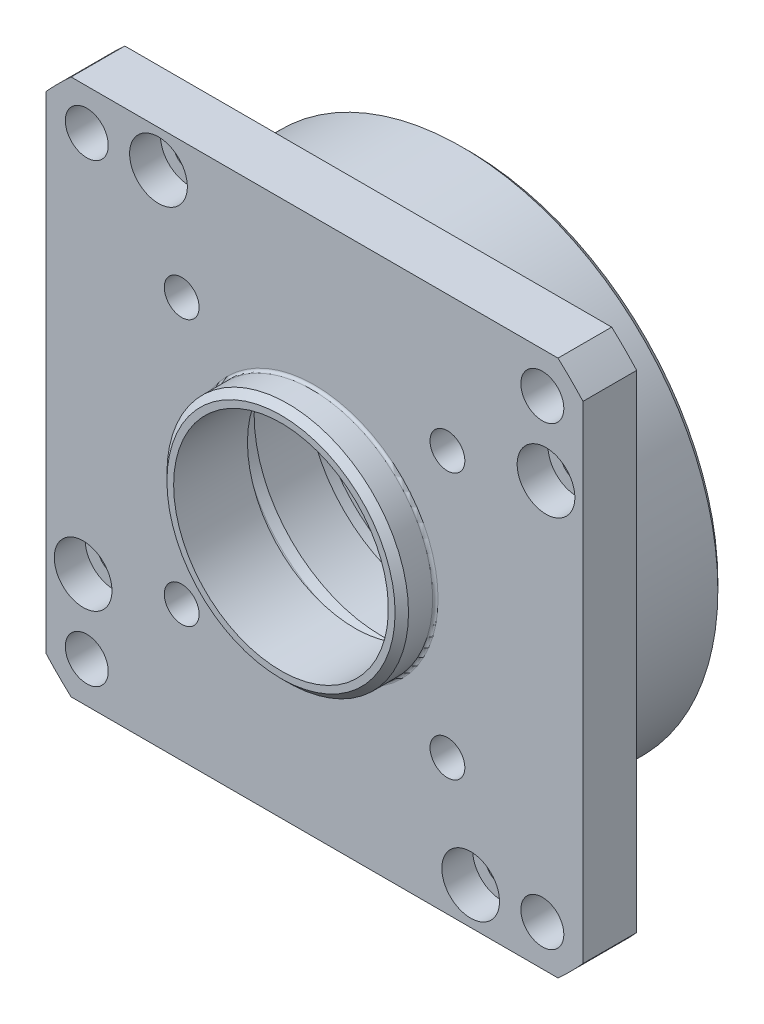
ISO-10303-21;
HEADER;
FILE_DESCRIPTION(('STEP AP214'),'2;1');
FILE_NAME('part.step','',(''),(''),'','','');
FILE_SCHEMA(('AUTOMOTIVE_DESIGN { 1 0 10303 214 1 1 1 1 }'));
ENDSEC;
DATA;
#1=APPLICATION_CONTEXT('core data for automotive mechanical design processes');
#2=APPLICATION_PROTOCOL_DEFINITION('international standard','automotive_design',2000,#1);
#3=PRODUCT_CONTEXT('',#1,'mechanical');
#4=PRODUCT('Part','Part','',(#3));
#5=PRODUCT_RELATED_PRODUCT_CATEGORY('part','',(#4));
#6=PRODUCT_DEFINITION_FORMATION('','',#4);
#7=PRODUCT_DEFINITION_CONTEXT('part definition',#1,'design');
#8=PRODUCT_DEFINITION('design','',#6,#7);
#9=PRODUCT_DEFINITION_SHAPE('','',#8);
#10=(LENGTH_UNIT() NAMED_UNIT(*) SI_UNIT(.MILLI.,.METRE.));
#11=(NAMED_UNIT(*) PLANE_ANGLE_UNIT() SI_UNIT($,.RADIAN.));
#12=(NAMED_UNIT(*) SI_UNIT($,.STERADIAN.) SOLID_ANGLE_UNIT());
#13=UNCERTAINTY_MEASURE_WITH_UNIT(LENGTH_MEASURE(1.E-05),#10,'distance_accuracy_value','');
#14=(GEOMETRIC_REPRESENTATION_CONTEXT(3) GLOBAL_UNCERTAINTY_ASSIGNED_CONTEXT((#13)) GLOBAL_UNIT_ASSIGNED_CONTEXT((#10,
#11,#12)) REPRESENTATION_CONTEXT('',''));
#15=CARTESIAN_POINT('',(0.,0.,0.));
#16=DIRECTION('',(0.,0.,1.));
#17=DIRECTION('',(1.,0.,0.));
#18=AXIS2_PLACEMENT_3D('',#15,#16,#17);
#19=CARTESIAN_POINT('',(0.,0.,-7.5));
#20=DIRECTION('',(0.,0.,1.));
#21=DIRECTION('',(1.,0.,0.));
#22=AXIS2_PLACEMENT_3D('',#19,#20,#21);
#23=CYLINDRICAL_SURFACE('',#22,9.5);
#24=CARTESIAN_POINT('',(0.,0.,-1.00000000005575));
#25=DIRECTION('',(0.,0.,1.));
#26=DIRECTION('',(-1.,0.,0.));
#27=AXIS2_PLACEMENT_3D('',#24,#25,#26);
#28=CIRCLE('',#27,9.50000000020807);
#29=CARTESIAN_POINT('',(-9.50000000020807,0.,-1.00000000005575));
#30=VERTEX_POINT('',#29);
#31=EDGE_CURVE('E409',#30,#30,#28,.T.);
#32=ORIENTED_EDGE('',*,*,#31,.T.);
#33=EDGE_LOOP('',(#32));
#34=FACE_BOUND('',#33,.T.);
#35=CARTESIAN_POINT('',(0.,0.,-4.9));
#36=DIRECTION('',(0.,0.,1.));
#37=DIRECTION('',(1.,0.,0.));
#38=AXIS2_PLACEMENT_3D('',#35,#36,#37);
#39=CIRCLE('',#38,9.5);
#40=CARTESIAN_POINT('',(9.5,0.,-4.9));
#41=VERTEX_POINT('',#40);
#42=EDGE_CURVE('E20',#41,#41,#39,.T.);
#43=ORIENTED_EDGE('',*,*,#42,.F.);
#44=EDGE_LOOP('',(#43));
#45=FACE_BOUND('',#44,.T.);
#46=ADVANCED_FACE('F17',(#34,#45),#23,.F.);
#47=CARTESIAN_POINT('',(0.,0.,-0.304456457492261));
#48=DIRECTION('',(0.,0.,1.));
#49=DIRECTION('',(1.,0.,0.));
#50=AXIS2_PLACEMENT_3D('',#47,#48,#49);
#51=CONICAL_SURFACE('',#50,9.68637033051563,0.2617993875);
#52=CARTESIAN_POINT('',(0.,0.,-0.304456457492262));
#53=DIRECTION('',(0.,0.,-1.));
#54=DIRECTION('',(1.,0.,0.));
#55=AXIS2_PLACEMENT_3D('',#52,#53,#54);
#56=CIRCLE('',#55,9.68637033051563);
#57=CARTESIAN_POINT('',(9.68637033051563,0.,-0.304456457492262));
#58=VERTEX_POINT('',#57);
#59=EDGE_CURVE('E216',#58,#58,#56,.F.);
#60=ORIENTED_EDGE('',*,*,#59,.T.);
#61=EDGE_LOOP('',(#60));
#62=FACE_BOUND('',#61,.T.);
#63=ORIENTED_EDGE('',*,*,#31,.F.);
#64=EDGE_LOOP('',(#63));
#65=FACE_BOUND('',#64,.T.);
#66=ADVANCED_FACE('F227',(#62,#65),#51,.F.);
#67=CARTESIAN_POINT('',(0.,0.,-4.9));
#68=DIRECTION('',(0.,0.,-1.));
#69=DIRECTION('',(-1.,0.,0.));
#70=AXIS2_PLACEMENT_3D('',#67,#68,#69);
#71=PLANE('',#70);
#72=ORIENTED_EDGE('',*,*,#42,.T.);
#73=EDGE_LOOP('',(#72));
#74=FACE_BOUND('',#73,.T.);
#75=CARTESIAN_POINT('',(0.,0.,-4.9));
#76=DIRECTION('',(0.,0.,-1.));
#77=DIRECTION('',(-1.,0.,0.));
#78=AXIS2_PLACEMENT_3D('',#75,#76,#77);
#79=CIRCLE('',#78,10.);
#80=CARTESIAN_POINT('',(-10.,0.,-4.9));
#81=VERTEX_POINT('',#80);
#82=EDGE_CURVE('E211',#81,#81,#79,.T.);
#83=ORIENTED_EDGE('',*,*,#82,.T.);
#84=EDGE_LOOP('',(#83));
#85=FACE_BOUND('',#84,.T.);
#86=ADVANCED_FACE('F224',(#74,#85),#71,.T.);
#87=CARTESIAN_POINT('',(0.,0.,-0.20092883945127));
#88=DIRECTION('',(0.,0.,-1.));
#89=DIRECTION('',(1.,0.,0.));
#90=AXIS2_PLACEMENT_3D('',#87,#88,#89);
#91=TOROIDAL_SURFACE('',#90,9.3,0.399999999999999);
#92=CARTESIAN_POINT('',(0.,0.,-0.20092883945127));
#93=DIRECTION('',(0.,0.,-1.));
#94=DIRECTION('',(-1.,0.,0.));
#95=AXIS2_PLACEMENT_3D('',#92,#93,#94);
#96=CIRCLE('',#95,9.7);
#97=CARTESIAN_POINT('',(-9.7,0.,-0.20092883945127));
#98=VERTEX_POINT('',#97);
#99=EDGE_CURVE('E202',#98,#98,#96,.F.);
#100=ORIENTED_EDGE('',*,*,#99,.T.);
#101=EDGE_LOOP('',(#100));
#102=FACE_BOUND('',#101,.T.);
#103=ORIENTED_EDGE('',*,*,#59,.F.);
#104=EDGE_LOOP('',(#103));
#105=FACE_BOUND('',#104,.T.);
#106=ADVANCED_FACE('F219',(#102,#105),#91,.F.);
#107=CARTESIAN_POINT('',(0.,0.,-5.45));
#108=DIRECTION('',(0.,0.,-1.));
#109=DIRECTION('',(-1.,0.,0.));
#110=AXIS2_PLACEMENT_3D('',#107,#108,#109);
#111=CYLINDRICAL_SURFACE('',#110,10.);
#112=ORIENTED_EDGE('',*,*,#82,.F.);
#113=EDGE_LOOP('',(#112));
#114=FACE_BOUND('',#113,.T.);
#115=CARTESIAN_POINT('',(0.,0.,-6.));
#116=DIRECTION('',(0.,0.,-1.));
#117=DIRECTION('',(-1.,0.,0.));
#118=AXIS2_PLACEMENT_3D('',#115,#116,#117);
#119=CIRCLE('',#118,10.);
#120=CARTESIAN_POINT('',(-10.,0.,-6.));
#121=VERTEX_POINT('',#120);
#122=EDGE_CURVE('E210',#121,#121,#119,.T.);
#123=ORIENTED_EDGE('',*,*,#122,.T.);
#124=EDGE_LOOP('',(#123));
#125=FACE_BOUND('',#124,.T.);
#126=ADVANCED_FACE('F223',(#114,#125),#111,.F.);
#127=CARTESIAN_POINT('',(0.,0.,6.));
#128=DIRECTION('',(0.,0.,-1.));
#129=DIRECTION('',(-1.,0.,0.));
#130=AXIS2_PLACEMENT_3D('',#127,#128,#129);
#131=CYLINDRICAL_SURFACE('',#130,9.7);
#132=CARTESIAN_POINT('',(0.,0.,0.600000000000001));
#133=DIRECTION('',(0.,0.,-1.));
#134=DIRECTION('',(1.,0.,0.));
#135=AXIS2_PLACEMENT_3D('',#132,#133,#134);
#136=CIRCLE('',#135,9.7);
#137=CARTESIAN_POINT('',(9.7,0.,0.600000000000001));
#138=VERTEX_POINT('',#137);
#139=EDGE_CURVE('E402',#138,#138,#136,.F.);
#140=ORIENTED_EDGE('',*,*,#139,.T.);
#141=EDGE_LOOP('',(#140));
#142=FACE_BOUND('',#141,.T.);
#143=ORIENTED_EDGE('',*,*,#99,.F.);
#144=EDGE_LOOP('',(#143));
#145=FACE_BOUND('',#144,.T.);
#146=ADVANCED_FACE('F621',(#142,#145),#131,.F.);
#147=CARTESIAN_POINT('',(0.,0.,-6.));
#148=DIRECTION('',(0.,0.,-1.));
#149=DIRECTION('',(-1.,0.,0.));
#150=AXIS2_PLACEMENT_3D('',#147,#148,#149);
#151=PLANE('',#150);
#152=CARTESIAN_POINT('',(0.,0.,-6.));
#153=DIRECTION('',(0.,0.,1.));
#154=DIRECTION('',(1.,0.,0.));
#155=AXIS2_PLACEMENT_3D('',#152,#153,#154);
#156=CIRCLE('',#155,9.5);
#157=CARTESIAN_POINT('',(9.5,0.,-6.));
#158=VERTEX_POINT('',#157);
#159=EDGE_CURVE('E399',#158,#158,#156,.F.);
#160=ORIENTED_EDGE('',*,*,#159,.T.);
#161=EDGE_LOOP('',(#160));
#162=FACE_BOUND('',#161,.T.);
#163=ORIENTED_EDGE('',*,*,#122,.F.);
#164=EDGE_LOOP('',(#163));
#165=FACE_BOUND('',#164,.T.);
#166=ADVANCED_FACE('F193',(#162,#165),#151,.F.);
#167=CARTESIAN_POINT('',(0.,0.,0.600000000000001));
#168=DIRECTION('',(0.,0.,-1.));
#169=DIRECTION('',(1.,0.,0.));
#170=AXIS2_PLACEMENT_3D('',#167,#168,#169);
#171=TOROIDAL_SURFACE('',#170,9.3,0.4);
#172=CARTESIAN_POINT('',(0.,0.,1.));
#173=DIRECTION('',(0.,0.,1.));
#174=DIRECTION('',(-1.,0.,0.));
#175=AXIS2_PLACEMENT_3D('',#172,#173,#174);
#176=CIRCLE('',#175,9.3);
#177=CARTESIAN_POINT('',(-9.3,0.,1.));
#178=VERTEX_POINT('',#177);
#179=EDGE_CURVE('E160',#178,#178,#176,.T.);
#180=ORIENTED_EDGE('',*,*,#179,.T.);
#181=EDGE_LOOP('',(#180));
#182=FACE_BOUND('',#181,.T.);
#183=ORIENTED_EDGE('',*,*,#139,.F.);
#184=EDGE_LOOP('',(#183));
#185=FACE_BOUND('',#184,.T.);
#186=ADVANCED_FACE('F188',(#182,#185),#171,.F.);
#187=CARTESIAN_POINT('',(0.,0.,-7.5));
#188=DIRECTION('',(0.,0.,1.));
#189=DIRECTION('',(1.,0.,0.));
#190=AXIS2_PLACEMENT_3D('',#187,#188,#189);
#191=CYLINDRICAL_SURFACE('',#190,9.5);
#192=ORIENTED_EDGE('',*,*,#159,.F.);
#193=EDGE_LOOP('',(#192));
#194=FACE_BOUND('',#193,.T.);
#195=CARTESIAN_POINT('',(0.,0.,-6.99999999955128));
#196=DIRECTION('',(0.,0.,-1.));
#197=DIRECTION('',(1.,0.,0.));
#198=AXIS2_PLACEMENT_3D('',#195,#196,#197);
#199=CIRCLE('',#198,9.50000000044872);
#200=CARTESIAN_POINT('',(9.50000000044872,0.,-6.99999999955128));
#201=VERTEX_POINT('',#200);
#202=EDGE_CURVE('E156',#201,#201,#199,.T.);
#203=ORIENTED_EDGE('',*,*,#202,.T.);
#204=EDGE_LOOP('',(#203));
#205=FACE_BOUND('',#204,.T.);
#206=ADVANCED_FACE('F184',(#194,#205),#191,.F.);
#207=CARTESIAN_POINT('',(0.,0.,1.));
#208=DIRECTION('',(0.,0.,1.));
#209=DIRECTION('',(1.,0.,0.));
#210=AXIS2_PLACEMENT_3D('',#207,#208,#209);
#211=PLANE('',#210);
#212=ORIENTED_EDGE('',*,*,#179,.F.);
#213=EDGE_LOOP('',(#212));
#214=FACE_BOUND('',#213,.T.);
#215=CARTESIAN_POINT('',(0.,0.,1.));
#216=DIRECTION('',(0.,0.,-1.));
#217=DIRECTION('',(-1.,0.,0.));
#218=AXIS2_PLACEMENT_3D('',#215,#216,#217);
#219=CIRCLE('',#218,8.);
#220=CARTESIAN_POINT('',(-8.,0.,1.));
#221=VERTEX_POINT('',#220);
#222=EDGE_CURVE('E159',#221,#221,#219,.F.);
#223=ORIENTED_EDGE('',*,*,#222,.T.);
#224=EDGE_LOOP('',(#223));
#225=FACE_BOUND('',#224,.T.);
#226=ADVANCED_FACE('F173',(#214,#225),#211,.F.);
#227=CARTESIAN_POINT('',(0.,0.,-7.5));
#228=DIRECTION('',(0.,0.,-1.));
#229=DIRECTION('',(-1.,0.,0.));
#230=AXIS2_PLACEMENT_3D('',#227,#228,#229);
#231=CONICAL_SURFACE('',#230,10.,0.785398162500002);
#232=CARTESIAN_POINT('',(0.,0.,-7.5));
#233=DIRECTION('',(0.,0.,-1.));
#234=DIRECTION('',(-1.,0.,0.));
#235=AXIS2_PLACEMENT_3D('',#232,#233,#234);
#236=CIRCLE('',#235,10.);
#237=CARTESIAN_POINT('',(-10.,0.,-7.5));
#238=VERTEX_POINT('',#237);
#239=EDGE_CURVE('E394',#238,#238,#236,.F.);
#240=ORIENTED_EDGE('',*,*,#239,.F.);
#241=EDGE_LOOP('',(#240));
#242=FACE_BOUND('',#241,.T.);
#243=ORIENTED_EDGE('',*,*,#202,.F.);
#244=EDGE_LOOP('',(#243));
#245=FACE_BOUND('',#244,.T.);
#246=ADVANCED_FACE('F183',(#242,#245),#231,.F.);
#247=CARTESIAN_POINT('',(0.,0.,6.5));
#248=DIRECTION('',(0.,0.,-1.));
#249=DIRECTION('',(-1.,0.,0.));
#250=AXIS2_PLACEMENT_3D('',#247,#248,#249);
#251=CYLINDRICAL_SURFACE('',#250,8.);
#252=CARTESIAN_POINT('',(0.,0.,6.5));
#253=DIRECTION('',(0.,0.,-1.));
#254=DIRECTION('',(-1.,0.,0.));
#255=AXIS2_PLACEMENT_3D('',#252,#253,#254);
#256=CIRCLE('',#255,8.);
#257=CARTESIAN_POINT('',(-8.,0.,6.5));
#258=VERTEX_POINT('',#257);
#259=EDGE_CURVE('E391',#258,#258,#256,.T.);
#260=ORIENTED_EDGE('',*,*,#259,.F.);
#261=EDGE_LOOP('',(#260));
#262=FACE_BOUND('',#261,.T.);
#263=ORIENTED_EDGE('',*,*,#222,.F.);
#264=EDGE_LOOP('',(#263));
#265=FACE_BOUND('',#264,.T.);
#266=ADVANCED_FACE('F592',(#262,#265),#251,.F.);
#267=CARTESIAN_POINT('',(0.,0.,-7.5));
#268=DIRECTION('',(0.,0.,-1.));
#269=DIRECTION('',(-1.,0.,0.));
#270=AXIS2_PLACEMENT_3D('',#267,#268,#269);
#271=PLANE('',#270);
#272=CARTESIAN_POINT('',(0.,0.,-7.50000000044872));
#273=DIRECTION('',(0.,0.,1.));
#274=DIRECTION('',(1.,0.,0.));
#275=AXIS2_PLACEMENT_3D('',#272,#273,#274);
#276=CIRCLE('',#275,18.5500000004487);
#277=CARTESIAN_POINT('',(18.5500000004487,0.,-7.50000000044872));
#278=VERTEX_POINT('',#277);
#279=EDGE_CURVE('E387',#278,#278,#276,.T.);
#280=ORIENTED_EDGE('',*,*,#279,.F.);
#281=EDGE_LOOP('',(#280));
#282=FACE_BOUND('',#281,.T.);
#283=ORIENTED_EDGE('',*,*,#239,.T.);
#284=EDGE_LOOP('',(#283));
#285=FACE_BOUND('',#284,.T.);
#286=ADVANCED_FACE('F589',(#282,#285),#271,.T.);
#287=CARTESIAN_POINT('',(0.,0.,6.5));
#288=DIRECTION('',(0.,0.,1.));
#289=DIRECTION('',(1.,0.,0.));
#290=AXIS2_PLACEMENT_3D('',#287,#288,#289);
#291=PLANE('',#290);
#292=ORIENTED_EDGE('',*,*,#259,.T.);
#293=EDGE_LOOP('',(#292));
#294=FACE_BOUND('',#293,.T.);
#295=CARTESIAN_POINT('',(0.,0.,6.5));
#296=DIRECTION('',(0.,0.,-1.));
#297=DIRECTION('',(-1.,0.,0.));
#298=AXIS2_PLACEMENT_3D('',#295,#296,#297);
#299=CIRCLE('',#298,8.5);
#300=CARTESIAN_POINT('',(-8.5,0.,6.5));
#301=VERTEX_POINT('',#300);
#302=EDGE_CURVE('E153',#301,#301,#299,.T.);
#303=ORIENTED_EDGE('',*,*,#302,.F.);
#304=EDGE_LOOP('',(#303));
#305=FACE_BOUND('',#304,.T.);
#306=ADVANCED_FACE('F585',(#294,#305),#291,.T.);
#307=CARTESIAN_POINT('',(0.,0.,-7.));
#308=DIRECTION('',(0.,0.,1.));
#309=DIRECTION('',(1.,0.,0.));
#310=AXIS2_PLACEMENT_3D('',#307,#308,#309);
#311=CONICAL_SURFACE('',#310,19.05,0.785398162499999);
#312=CARTESIAN_POINT('',(0.,0.,-7.));
#313=DIRECTION('',(0.,0.,-1.));
#314=DIRECTION('',(-1.,0.,0.));
#315=AXIS2_PLACEMENT_3D('',#312,#313,#314);
#316=CIRCLE('',#315,19.05);
#317=CARTESIAN_POINT('',(-19.05,0.,-7.));
#318=VERTEX_POINT('',#317);
#319=EDGE_CURVE('E148',#318,#318,#316,.F.);
#320=ORIENTED_EDGE('',*,*,#319,.F.);
#321=EDGE_LOOP('',(#320));
#322=FACE_BOUND('',#321,.T.);
#323=ORIENTED_EDGE('',*,*,#279,.T.);
#324=EDGE_LOOP('',(#323));
#325=FACE_BOUND('',#324,.T.);
#326=ADVANCED_FACE('F581',(#322,#325),#311,.T.);
#327=CARTESIAN_POINT('',(0.,0.,5.99999999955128));
#328=DIRECTION('',(0.,0.,-1.));
#329=DIRECTION('',(-1.,0.,0.));
#330=AXIS2_PLACEMENT_3D('',#327,#328,#329);
#331=CONICAL_SURFACE('',#330,8.99999999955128,0.785398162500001);
#332=ORIENTED_EDGE('',*,*,#302,.T.);
#333=EDGE_LOOP('',(#332));
#334=FACE_BOUND('',#333,.T.);
#335=CARTESIAN_POINT('',(0.,0.,6.));
#336=DIRECTION('',(0.,0.,1.));
#337=DIRECTION('',(1.,0.,0.));
#338=AXIS2_PLACEMENT_3D('',#335,#336,#337);
#339=CIRCLE('',#338,9.);
#340=CARTESIAN_POINT('',(9.,0.,6.));
#341=VERTEX_POINT('',#340);
#342=EDGE_CURVE('E141',#341,#341,#339,.F.);
#343=ORIENTED_EDGE('',*,*,#342,.F.);
#344=EDGE_LOOP('',(#343));
#345=FACE_BOUND('',#344,.T.);
#346=ADVANCED_FACE('F577',(#334,#345),#331,.T.);
#347=CARTESIAN_POINT('',(11.6312123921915,-17.2439815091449,-26.5000309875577));
#348=DIRECTION('',(0.,0.,-1.));
#349=DIRECTION('',(-1.,0.,0.));
#350=AXIS2_PLACEMENT_3D('',#347,#348,#349);
#351=CYLINDRICAL_SURFACE('',#350,1.2);
#352=CARTESIAN_POINT('',(11.6312123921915,-17.2439815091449,1.7));
#353=DIRECTION('',(0.,0.,-1.));
#354=DIRECTION('',(-1.,0.,0.));
#355=AXIS2_PLACEMENT_3D('',#352,#353,#354);
#356=CIRCLE('',#355,1.2);
#357=CARTESIAN_POINT('',(10.4312123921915,-17.2439815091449,1.7));
#358=VERTEX_POINT('',#357);
#359=EDGE_CURVE('E152',#358,#358,#356,.F.);
#360=ORIENTED_EDGE('',*,*,#359,.T.);
#361=EDGE_LOOP('',(#360));
#362=FACE_BOUND('',#361,.T.);
#363=CARTESIAN_POINT('',(11.6312123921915,-17.2439815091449,0.));
#364=DIRECTION('',(0.,0.,-1.));
#365=DIRECTION('',(-1.,0.,0.));
#366=AXIS2_PLACEMENT_3D('',#363,#364,#365);
#367=CIRCLE('',#366,1.2);
#368=CARTESIAN_POINT('',(10.4312123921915,-17.2439815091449,0.));
#369=VERTEX_POINT('',#368);
#370=EDGE_CURVE('E144',#369,#369,#367,.F.);
#371=ORIENTED_EDGE('',*,*,#370,.F.);
#372=EDGE_LOOP('',(#371));
#373=FACE_BOUND('',#372,.T.);
#374=ADVANCED_FACE('F573',(#362,#373),#351,.F.);
#375=CARTESIAN_POINT('',(-17.2439815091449,-11.6312123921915,-26.5000309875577));
#376=DIRECTION('',(0.,0.,-1.));
#377=DIRECTION('',(-1.,0.,0.));
#378=AXIS2_PLACEMENT_3D('',#375,#376,#377);
#379=CYLINDRICAL_SURFACE('',#378,1.2);
#380=CARTESIAN_POINT('',(-17.2439815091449,-11.6312123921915,1.7));
#381=DIRECTION('',(0.,0.,-1.));
#382=DIRECTION('',(-1.,0.,0.));
#383=AXIS2_PLACEMENT_3D('',#380,#381,#382);
#384=CIRCLE('',#383,1.2);
#385=CARTESIAN_POINT('',(-18.4439815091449,-11.6312123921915,1.7));
#386=VERTEX_POINT('',#385);
#387=EDGE_CURVE('E380',#386,#386,#384,.F.);
#388=ORIENTED_EDGE('',*,*,#387,.T.);
#389=EDGE_LOOP('',(#388));
#390=FACE_BOUND('',#389,.T.);
#391=CARTESIAN_POINT('',(-17.2439815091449,-11.6312123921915,0.));
#392=DIRECTION('',(0.,0.,-1.));
#393=DIRECTION('',(-1.,0.,0.));
#394=AXIS2_PLACEMENT_3D('',#391,#392,#393);
#395=CIRCLE('',#394,1.2);
#396=CARTESIAN_POINT('',(-18.4439815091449,-11.6312123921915,0.));
#397=VERTEX_POINT('',#396);
#398=EDGE_CURVE('E369',#397,#397,#395,.F.);
#399=ORIENTED_EDGE('',*,*,#398,.F.);
#400=EDGE_LOOP('',(#399));
#401=FACE_BOUND('',#400,.T.);
#402=ADVANCED_FACE('F569',(#390,#401),#379,.F.);
#403=CARTESIAN_POINT('',(-11.6312123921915,17.2439815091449,-26.5000309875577));
#404=DIRECTION('',(0.,0.,-1.));
#405=DIRECTION('',(-1.,0.,0.));
#406=AXIS2_PLACEMENT_3D('',#403,#404,#405);
#407=CYLINDRICAL_SURFACE('',#406,1.2);
#408=CARTESIAN_POINT('',(-11.6312123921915,17.2439815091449,1.7));
#409=DIRECTION('',(0.,0.,-1.));
#410=DIRECTION('',(-1.,0.,0.));
#411=AXIS2_PLACEMENT_3D('',#408,#409,#410);
#412=CIRCLE('',#411,1.2);
#413=CARTESIAN_POINT('',(-12.8312123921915,17.2439815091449,1.7));
#414=VERTEX_POINT('',#413);
#415=EDGE_CURVE('E376',#414,#414,#412,.F.);
#416=ORIENTED_EDGE('',*,*,#415,.T.);
#417=EDGE_LOOP('',(#416));
#418=FACE_BOUND('',#417,.T.);
#419=CARTESIAN_POINT('',(-11.6312123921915,17.2439815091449,0.));
#420=DIRECTION('',(0.,0.,-1.));
#421=DIRECTION('',(-1.,0.,0.));
#422=AXIS2_PLACEMENT_3D('',#419,#420,#421);
#423=CIRCLE('',#422,1.2);
#424=CARTESIAN_POINT('',(-12.8312123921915,17.2439815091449,0.));
#425=VERTEX_POINT('',#424);
#426=EDGE_CURVE('E365',#425,#425,#423,.F.);
#427=ORIENTED_EDGE('',*,*,#426,.F.);
#428=EDGE_LOOP('',(#427));
#429=FACE_BOUND('',#428,.T.);
#430=ADVANCED_FACE('F565',(#418,#429),#407,.F.);
#431=CARTESIAN_POINT('',(17.2439815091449,11.6312123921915,-26.5000309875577));
#432=DIRECTION('',(0.,0.,-1.));
#433=DIRECTION('',(-1.,0.,0.));
#434=AXIS2_PLACEMENT_3D('',#431,#432,#433);
#435=CYLINDRICAL_SURFACE('',#434,1.2);
#436=CARTESIAN_POINT('',(17.2439815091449,11.6312123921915,1.7));
#437=DIRECTION('',(0.,0.,-1.));
#438=DIRECTION('',(-1.,0.,0.));
#439=AXIS2_PLACEMENT_3D('',#436,#437,#438);
#440=CIRCLE('',#439,1.2);
#441=CARTESIAN_POINT('',(16.0439815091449,11.6312123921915,1.7));
#442=VERTEX_POINT('',#441);
#443=EDGE_CURVE('E145',#442,#442,#440,.F.);
#444=ORIENTED_EDGE('',*,*,#443,.T.);
#445=EDGE_LOOP('',(#444));
#446=FACE_BOUND('',#445,.T.);
#447=CARTESIAN_POINT('',(17.2439815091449,11.6312123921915,0.));
#448=DIRECTION('',(0.,0.,-1.));
#449=DIRECTION('',(-1.,0.,0.));
#450=AXIS2_PLACEMENT_3D('',#447,#448,#449);
#451=CIRCLE('',#450,1.2);
#452=CARTESIAN_POINT('',(16.0439815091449,11.6312123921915,0.));
#453=VERTEX_POINT('',#452);
#454=EDGE_CURVE('E362',#453,#453,#451,.F.);
#455=ORIENTED_EDGE('',*,*,#454,.F.);
#456=EDGE_LOOP('',(#455));
#457=FACE_BOUND('',#456,.T.);
#458=ADVANCED_FACE('F561',(#446,#457),#435,.F.);
#459=CARTESIAN_POINT('',(0.,0.,0.));
#460=DIRECTION('',(0.,0.,-1.));
#461=DIRECTION('',(-1.,0.,0.));
#462=AXIS2_PLACEMENT_3D('',#459,#460,#461);
#463=CYLINDRICAL_SURFACE('',#462,19.05);
#464=CARTESIAN_POINT('',(0.,0.,0.));
#465=DIRECTION('',(0.,0.,-1.));
#466=DIRECTION('',(-1.,0.,0.));
#467=AXIS2_PLACEMENT_3D('',#464,#465,#466);
#468=CIRCLE('',#467,19.05);
#469=CARTESIAN_POINT('',(-19.05,0.,0.));
#470=VERTEX_POINT('',#469);
#471=EDGE_CURVE('E359',#470,#470,#468,.F.);
#472=ORIENTED_EDGE('',*,*,#471,.F.);
#473=EDGE_LOOP('',(#472));
#474=FACE_BOUND('',#473,.T.);
#475=ORIENTED_EDGE('',*,*,#319,.T.);
#476=EDGE_LOOP('',(#475));
#477=FACE_BOUND('',#476,.T.);
#478=ADVANCED_FACE('F104',(#474,#477),#463,.T.);
#479=CARTESIAN_POINT('',(9.89949493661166,-9.89949493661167,-4.00000000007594));
#480=DIRECTION('',(0.,0.,1.));
#481=DIRECTION('',(1.,0.,0.));
#482=AXIS2_PLACEMENT_3D('',#479,#480,#481);
#483=CONICAL_SURFACE('',#482,1.29704999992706,1.02974425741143);
#484=CARTESIAN_POINT('',(9.89949493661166,-9.89949493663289,-4.77934626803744));
#485=VERTEX_POINT('',#484);
#486=VERTEX_LOOP('',#485);
#487=FACE_BOUND('',#486,.T.);
#488=CARTESIAN_POINT('',(9.89949493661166,-9.89949493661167,-4.));
#489=DIRECTION('',(0.,0.,-1.));
#490=DIRECTION('',(-1.,0.,0.));
#491=AXIS2_PLACEMENT_3D('',#488,#489,#490);
#492=CIRCLE('',#491,1.29705);
#493=CARTESIAN_POINT('',(8.60244493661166,-9.89949493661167,-4.));
#494=VERTEX_POINT('',#493);
#495=EDGE_CURVE('E108',#494,#494,#492,.F.);
#496=ORIENTED_EDGE('',*,*,#495,.T.);
#497=EDGE_LOOP('',(#496));
#498=FACE_BOUND('',#497,.T.);
#499=ADVANCED_FACE('F100',(#487,#498),#483,.F.);
#500=CARTESIAN_POINT('',(-9.89949493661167,-9.89949493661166,-4.00000000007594));
#501=DIRECTION('',(0.,0.,1.));
#502=DIRECTION('',(1.,0.,0.));
#503=AXIS2_PLACEMENT_3D('',#500,#501,#502);
#504=CONICAL_SURFACE('',#503,1.29704999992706,1.02974425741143);
#505=CARTESIAN_POINT('',(-9.89949493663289,-9.89949493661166,-4.77934626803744));
#506=VERTEX_POINT('',#505);
#507=VERTEX_LOOP('',#506);
#508=FACE_BOUND('',#507,.T.);
#509=CARTESIAN_POINT('',(-9.89949493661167,-9.89949493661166,-4.));
#510=DIRECTION('',(0.,0.,-1.));
#511=DIRECTION('',(-1.,0.,0.));
#512=AXIS2_PLACEMENT_3D('',#509,#510,#511);
#513=CIRCLE('',#512,1.29705);
#514=CARTESIAN_POINT('',(-11.1965449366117,-9.89949493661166,-4.));
#515=VERTEX_POINT('',#514);
#516=EDGE_CURVE('E110',#515,#515,#513,.F.);
#517=ORIENTED_EDGE('',*,*,#516,.T.);
#518=EDGE_LOOP('',(#517));
#519=FACE_BOUND('',#518,.T.);
#520=ADVANCED_FACE('F103',(#508,#519),#504,.F.);
#521=CARTESIAN_POINT('',(-9.89949493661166,9.89949493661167,-4.00000000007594));
#522=DIRECTION('',(0.,0.,1.));
#523=DIRECTION('',(1.,0.,0.));
#524=AXIS2_PLACEMENT_3D('',#521,#522,#523);
#525=CONICAL_SURFACE('',#524,1.29704999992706,1.02974425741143);
#526=CARTESIAN_POINT('',(-9.89949493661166,9.89949493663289,-4.77934626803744));
#527=VERTEX_POINT('',#526);
#528=VERTEX_LOOP('',#527);
#529=FACE_BOUND('',#528,.T.);
#530=CARTESIAN_POINT('',(-9.89949493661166,9.89949493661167,-4.));
#531=DIRECTION('',(0.,0.,-1.));
#532=DIRECTION('',(-1.,0.,0.));
#533=AXIS2_PLACEMENT_3D('',#530,#531,#532);
#534=CIRCLE('',#533,1.29705);
#535=CARTESIAN_POINT('',(-11.1965449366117,9.89949493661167,-4.));
#536=VERTEX_POINT('',#535);
#537=EDGE_CURVE('E114',#536,#536,#534,.F.);
#538=ORIENTED_EDGE('',*,*,#537,.T.);
#539=EDGE_LOOP('',(#538));
#540=FACE_BOUND('',#539,.T.);
#541=ADVANCED_FACE('F553',(#529,#540),#525,.F.);
#542=CARTESIAN_POINT('',(11.6312123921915,-17.2439815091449,1.7));
#543=DIRECTION('',(0.,0.,-1.));
#544=DIRECTION('',(-1.,0.,0.));
#545=AXIS2_PLACEMENT_3D('',#542,#543,#544);
#546=PLANE('',#545);
#547=CARTESIAN_POINT('',(11.6312123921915,-17.2439815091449,1.7));
#548=DIRECTION('',(0.,0.,-1.));
#549=DIRECTION('',(-1.,0.,0.));
#550=AXIS2_PLACEMENT_3D('',#547,#548,#549);
#551=CIRCLE('',#550,2.15);
#552=CARTESIAN_POINT('',(9.4812123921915,-17.2439815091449,1.7));
#553=VERTEX_POINT('',#552);
#554=EDGE_CURVE('E338',#553,#553,#551,.F.);
#555=ORIENTED_EDGE('',*,*,#554,.T.);
#556=EDGE_LOOP('',(#555));
#557=FACE_BOUND('',#556,.T.);
#558=ORIENTED_EDGE('',*,*,#359,.F.);
#559=EDGE_LOOP('',(#558));
#560=FACE_BOUND('',#559,.T.);
#561=ADVANCED_FACE('F549',(#557,#560),#546,.F.);
#562=CARTESIAN_POINT('',(-17.2439815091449,-11.6312123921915,1.7));
#563=DIRECTION('',(0.,0.,-1.));
#564=DIRECTION('',(-1.,0.,0.));
#565=AXIS2_PLACEMENT_3D('',#562,#563,#564);
#566=PLANE('',#565);
#567=CARTESIAN_POINT('',(-17.2439815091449,-11.6312123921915,1.7));
#568=DIRECTION('',(0.,0.,-1.));
#569=DIRECTION('',(-1.,0.,0.));
#570=AXIS2_PLACEMENT_3D('',#567,#568,#569);
#571=CIRCLE('',#570,2.15);
#572=CARTESIAN_POINT('',(-19.3939815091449,-11.6312123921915,1.7));
#573=VERTEX_POINT('',#572);
#574=EDGE_CURVE('E345',#573,#573,#571,.F.);
#575=ORIENTED_EDGE('',*,*,#574,.T.);
#576=EDGE_LOOP('',(#575));
#577=FACE_BOUND('',#576,.T.);
#578=ORIENTED_EDGE('',*,*,#387,.F.);
#579=EDGE_LOOP('',(#578));
#580=FACE_BOUND('',#579,.T.);
#581=ADVANCED_FACE('F546',(#577,#580),#566,.F.);
#582=CARTESIAN_POINT('',(-11.6312123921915,17.2439815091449,1.7));
#583=DIRECTION('',(0.,0.,-1.));
#584=DIRECTION('',(-1.,0.,0.));
#585=AXIS2_PLACEMENT_3D('',#582,#583,#584);
#586=PLANE('',#585);
#587=CARTESIAN_POINT('',(-11.6312123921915,17.2439815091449,1.7));
#588=DIRECTION('',(0.,0.,-1.));
#589=DIRECTION('',(-1.,0.,0.));
#590=AXIS2_PLACEMENT_3D('',#587,#588,#589);
#591=CIRCLE('',#590,2.15);
#592=CARTESIAN_POINT('',(-13.7812123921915,17.2439815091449,1.7));
#593=VERTEX_POINT('',#592);
#594=EDGE_CURVE('E350',#593,#593,#591,.F.);
#595=ORIENTED_EDGE('',*,*,#594,.T.);
#596=EDGE_LOOP('',(#595));
#597=FACE_BOUND('',#596,.T.);
#598=ORIENTED_EDGE('',*,*,#415,.F.);
#599=EDGE_LOOP('',(#598));
#600=FACE_BOUND('',#599,.T.);
#601=ADVANCED_FACE('F481',(#597,#600),#586,.F.);
#602=CARTESIAN_POINT('',(17.2439815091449,11.6312123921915,1.7));
#603=DIRECTION('',(0.,0.,-1.));
#604=DIRECTION('',(-1.,0.,0.));
#605=AXIS2_PLACEMENT_3D('',#602,#603,#604);
#606=PLANE('',#605);
#607=CARTESIAN_POINT('',(17.2439815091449,11.6312123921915,1.7));
#608=DIRECTION('',(0.,0.,-1.));
#609=DIRECTION('',(-1.,0.,0.));
#610=AXIS2_PLACEMENT_3D('',#607,#608,#609);
#611=CIRCLE('',#610,2.15);
#612=CARTESIAN_POINT('',(15.0939815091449,11.6312123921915,1.7));
#613=VERTEX_POINT('',#612);
#614=EDGE_CURVE('E332',#613,#613,#611,.F.);
#615=ORIENTED_EDGE('',*,*,#614,.T.);
#616=EDGE_LOOP('',(#615));
#617=FACE_BOUND('',#616,.T.);
#618=ORIENTED_EDGE('',*,*,#443,.F.);
#619=EDGE_LOOP('',(#618));
#620=FACE_BOUND('',#619,.T.);
#621=ADVANCED_FACE('F540',(#617,#620),#606,.F.);
#622=CARTESIAN_POINT('',(9.89949493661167,9.89949493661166,-4.00000000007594));
#623=DIRECTION('',(0.,0.,1.));
#624=DIRECTION('',(1.,0.,0.));
#625=AXIS2_PLACEMENT_3D('',#622,#623,#624);
#626=CONICAL_SURFACE('',#625,1.29704999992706,1.02974425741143);
#627=CARTESIAN_POINT('',(9.89949493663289,9.89949493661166,-4.77934626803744));
#628=VERTEX_POINT('',#627);
#629=VERTEX_LOOP('',#628);
#630=FACE_BOUND('',#629,.T.);
#631=CARTESIAN_POINT('',(9.89949493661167,9.89949493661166,-4.));
#632=DIRECTION('',(0.,0.,-1.));
#633=DIRECTION('',(-1.,0.,0.));
#634=AXIS2_PLACEMENT_3D('',#631,#632,#633);
#635=CIRCLE('',#634,1.29705);
#636=CARTESIAN_POINT('',(8.60244493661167,9.89949493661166,-4.));
#637=VERTEX_POINT('',#636);
#638=EDGE_CURVE('E323',#637,#637,#635,.F.);
#639=ORIENTED_EDGE('',*,*,#638,.T.);
#640=EDGE_LOOP('',(#639));
#641=FACE_BOUND('',#640,.T.);
#642=ADVANCED_FACE('F536',(#630,#641),#626,.F.);
#643=CARTESIAN_POINT('',(0.,0.,4.));
#644=DIRECTION('',(0.,0.,1.));
#645=DIRECTION('',(1.,0.,0.));
#646=AXIS2_PLACEMENT_3D('',#643,#644,#645);
#647=CYLINDRICAL_SURFACE('',#646,9.);
#648=ORIENTED_EDGE('',*,*,#342,.T.);
#649=EDGE_LOOP('',(#648));
#650=FACE_BOUND('',#649,.T.);
#651=CARTESIAN_POINT('',(0.,0.,4.2));
#652=DIRECTION('',(0.,0.,1.));
#653=DIRECTION('',(-1.,0.,0.));
#654=AXIS2_PLACEMENT_3D('',#651,#652,#653);
#655=CIRCLE('',#654,9.);
#656=CARTESIAN_POINT('',(-9.,0.,4.2));
#657=VERTEX_POINT('',#656);
#658=EDGE_CURVE('E127',#657,#657,#655,.T.);
#659=ORIENTED_EDGE('',*,*,#658,.T.);
#660=EDGE_LOOP('',(#659));
#661=FACE_BOUND('',#660,.T.);
#662=ADVANCED_FACE('F532',(#650,#661),#647,.T.);
#663=CARTESIAN_POINT('',(0.,0.,0.));
#664=DIRECTION('',(0.,0.,-1.));
#665=DIRECTION('',(-1.,0.,0.));
#666=AXIS2_PLACEMENT_3D('',#663,#664,#665);
#667=PLANE('',#666);
#668=DIRECTION('',(1.,0.,0.));
#669=VECTOR('',#668,1.);
#670=CARTESIAN_POINT('',(0.,-20.,0.));
#671=LINE('',#670,#669);
#672=CARTESIAN_POINT('',(-18.1383571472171,-20.,0.));
#673=VERTEX_POINT('',#672);
#674=CARTESIAN_POINT('',(18.1383571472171,-20.,0.));
#675=VERTEX_POINT('',#674);
#676=EDGE_CURVE('E128',#673,#675,#671,.T.);
#677=ORIENTED_EDGE('',*,*,#676,.F.);
#678=CARTESIAN_POINT('',(0.,0.,0.));
#679=DIRECTION('',(0.,0.,1.));
#680=DIRECTION('',(1.,0.,0.));
#681=AXIS2_PLACEMENT_3D('',#678,#679,#680);
#682=CIRCLE('',#681,27.);
#683=CARTESIAN_POINT('',(-20.,-18.1383571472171,0.));
#684=VERTEX_POINT('',#683);
#685=EDGE_CURVE('E131',#684,#673,#682,.T.);
#686=ORIENTED_EDGE('',*,*,#685,.F.);
#687=DIRECTION('',(0.,1.,0.));
#688=VECTOR('',#687,1.);
#689=CARTESIAN_POINT('',(-20.,0.,0.));
#690=LINE('',#689,#688);
#691=CARTESIAN_POINT('',(-20.,18.1383571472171,0.));
#692=VERTEX_POINT('',#691);
#693=EDGE_CURVE('E132',#692,#684,#690,.F.);
#694=ORIENTED_EDGE('',*,*,#693,.F.);
#695=CARTESIAN_POINT('',(0.,0.,0.));
#696=DIRECTION('',(0.,0.,1.));
#697=DIRECTION('',(1.,0.,0.));
#698=AXIS2_PLACEMENT_3D('',#695,#696,#697);
#699=CIRCLE('',#698,27.);
#700=CARTESIAN_POINT('',(-18.1383571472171,20.,0.));
#701=VERTEX_POINT('',#700);
#702=EDGE_CURVE('E135',#701,#692,#699,.T.);
#703=ORIENTED_EDGE('',*,*,#702,.F.);
#704=DIRECTION('',(1.,0.,0.));
#705=VECTOR('',#704,1.);
#706=CARTESIAN_POINT('',(0.,20.,0.));
#707=LINE('',#706,#705);
#708=CARTESIAN_POINT('',(18.1383571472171,20.,0.));
#709=VERTEX_POINT('',#708);
#710=EDGE_CURVE('E136',#709,#701,#707,.F.);
#711=ORIENTED_EDGE('',*,*,#710,.F.);
#712=CARTESIAN_POINT('',(0.,0.,0.));
#713=DIRECTION('',(0.,0.,1.));
#714=DIRECTION('',(1.,0.,0.));
#715=AXIS2_PLACEMENT_3D('',#712,#713,#714);
#716=CIRCLE('',#715,27.);
#717=CARTESIAN_POINT('',(20.,18.1383571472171,0.));
#718=VERTEX_POINT('',#717);
#719=EDGE_CURVE('E140',#718,#709,#716,.T.);
#720=ORIENTED_EDGE('',*,*,#719,.F.);
#721=DIRECTION('',(0.,1.,0.));
#722=VECTOR('',#721,1.);
#723=CARTESIAN_POINT('',(20.,0.,0.));
#724=LINE('',#723,#722);
#725=CARTESIAN_POINT('',(20.,-18.1383571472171,0.));
#726=VERTEX_POINT('',#725);
#727=EDGE_CURVE('E84',#726,#718,#724,.T.);
#728=ORIENTED_EDGE('',*,*,#727,.F.);
#729=CARTESIAN_POINT('',(0.,0.,0.));
#730=DIRECTION('',(0.,0.,1.));
#731=DIRECTION('',(1.,0.,0.));
#732=AXIS2_PLACEMENT_3D('',#729,#730,#731);
#733=CIRCLE('',#732,27.);
#734=EDGE_CURVE('E285',#675,#726,#733,.T.);
#735=ORIENTED_EDGE('',*,*,#734,.F.);
#736=EDGE_LOOP('',(#677,#686,#694,#703,#711,#720,#728,#735));
#737=FACE_BOUND('',#736,.T.);
#738=ORIENTED_EDGE('',*,*,#471,.T.);
#739=EDGE_LOOP('',(#738));
#740=FACE_BOUND('',#739,.T.);
#741=CARTESIAN_POINT('',(16.9705627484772,16.9705627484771,0.));
#742=DIRECTION('',(0.,0.,-1.));
#743=DIRECTION('',(-1.,0.,0.));
#744=AXIS2_PLACEMENT_3D('',#741,#742,#743);
#745=CIRCLE('',#744,1.6);
#746=CARTESIAN_POINT('',(15.3705627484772,16.9705627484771,0.));
#747=VERTEX_POINT('',#746);
#748=EDGE_CURVE('E331',#747,#747,#745,.F.);
#749=ORIENTED_EDGE('',*,*,#748,.T.);
#750=EDGE_LOOP('',(#749));
#751=FACE_BOUND('',#750,.T.);
#752=ORIENTED_EDGE('',*,*,#454,.T.);
#753=EDGE_LOOP('',(#752));
#754=FACE_BOUND('',#753,.T.);
#755=ORIENTED_EDGE('',*,*,#426,.T.);
#756=EDGE_LOOP('',(#755));
#757=FACE_BOUND('',#756,.T.);
#758=ORIENTED_EDGE('',*,*,#398,.T.);
#759=EDGE_LOOP('',(#758));
#760=FACE_BOUND('',#759,.T.);
#761=ORIENTED_EDGE('',*,*,#370,.T.);
#762=EDGE_LOOP('',(#761));
#763=FACE_BOUND('',#762,.T.);
#764=CARTESIAN_POINT('',(-16.9705627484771,16.9705627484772,0.));
#765=DIRECTION('',(0.,0.,-1.));
#766=DIRECTION('',(-1.,0.,0.));
#767=AXIS2_PLACEMENT_3D('',#764,#765,#766);
#768=CIRCLE('',#767,1.6);
#769=CARTESIAN_POINT('',(-18.5705627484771,16.9705627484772,0.));
#770=VERTEX_POINT('',#769);
#771=EDGE_CURVE('E111',#770,#770,#768,.F.);
#772=ORIENTED_EDGE('',*,*,#771,.T.);
#773=EDGE_LOOP('',(#772));
#774=FACE_BOUND('',#773,.T.);
#775=CARTESIAN_POINT('',(-16.9705627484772,-16.9705627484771,0.));
#776=DIRECTION('',(0.,0.,-1.));
#777=DIRECTION('',(-1.,0.,0.));
#778=AXIS2_PLACEMENT_3D('',#775,#776,#777);
#779=CIRCLE('',#778,1.6);
#780=CARTESIAN_POINT('',(-18.5705627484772,-16.9705627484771,0.));
#781=VERTEX_POINT('',#780);
#782=EDGE_CURVE('E118',#781,#781,#779,.F.);
#783=ORIENTED_EDGE('',*,*,#782,.T.);
#784=EDGE_LOOP('',(#783));
#785=FACE_BOUND('',#784,.T.);
#786=CARTESIAN_POINT('',(16.9705627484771,-16.9705627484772,0.));
#787=DIRECTION('',(0.,0.,-1.));
#788=DIRECTION('',(-1.,0.,0.));
#789=AXIS2_PLACEMENT_3D('',#786,#787,#788);
#790=CIRCLE('',#789,1.6);
#791=CARTESIAN_POINT('',(15.3705627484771,-16.9705627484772,0.));
#792=VERTEX_POINT('',#791);
#793=EDGE_CURVE('E356',#792,#792,#790,.F.);
#794=ORIENTED_EDGE('',*,*,#793,.T.);
#795=EDGE_LOOP('',(#794));
#796=FACE_BOUND('',#795,.T.);
#797=ADVANCED_FACE('F528',(#737,#740,#751,#754,#757,#760,#763,#774,#785,#796),#667,.T.);
#798=CARTESIAN_POINT('',(16.9705627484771,-16.9705627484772,4.));
#799=DIRECTION('',(0.,0.,-1.));
#800=DIRECTION('',(-1.,0.,0.));
#801=AXIS2_PLACEMENT_3D('',#798,#799,#800);
#802=CYLINDRICAL_SURFACE('',#801,1.6);
#803=CARTESIAN_POINT('',(16.9705627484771,-16.9705627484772,4.));
#804=DIRECTION('',(0.,0.,-1.));
#805=DIRECTION('',(-1.,0.,0.));
#806=AXIS2_PLACEMENT_3D('',#803,#804,#805);
#807=CIRCLE('',#806,1.6);
#808=CARTESIAN_POINT('',(15.3705627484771,-16.9705627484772,4.));
#809=VERTEX_POINT('',#808);
#810=EDGE_CURVE('E284',#809,#809,#807,.T.);
#811=ORIENTED_EDGE('',*,*,#810,.F.);
#812=EDGE_LOOP('',(#811));
#813=FACE_BOUND('',#812,.T.);
#814=ORIENTED_EDGE('',*,*,#793,.F.);
#815=EDGE_LOOP('',(#814));
#816=FACE_BOUND('',#815,.T.);
#817=ADVANCED_FACE('F524',(#813,#816),#802,.F.);
#818=CARTESIAN_POINT('',(-16.9705627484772,-16.9705627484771,4.));
#819=DIRECTION('',(0.,0.,-1.));
#820=DIRECTION('',(-1.,0.,0.));
#821=AXIS2_PLACEMENT_3D('',#818,#819,#820);
#822=CYLINDRICAL_SURFACE('',#821,1.6);
#823=CARTESIAN_POINT('',(-16.9705627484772,-16.9705627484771,4.));
#824=DIRECTION('',(0.,0.,-1.));
#825=DIRECTION('',(-1.,0.,0.));
#826=AXIS2_PLACEMENT_3D('',#823,#824,#825);
#827=CIRCLE('',#826,1.6);
#828=CARTESIAN_POINT('',(-18.5705627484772,-16.9705627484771,4.));
#829=VERTEX_POINT('',#828);
#830=EDGE_CURVE('E458',#829,#829,#827,.T.);
#831=ORIENTED_EDGE('',*,*,#830,.F.);
#832=EDGE_LOOP('',(#831));
#833=FACE_BOUND('',#832,.T.);
#834=ORIENTED_EDGE('',*,*,#782,.F.);
#835=EDGE_LOOP('',(#834));
#836=FACE_BOUND('',#835,.T.);
#837=ADVANCED_FACE('F520',(#833,#836),#822,.F.);
#838=CARTESIAN_POINT('',(-16.9705627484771,16.9705627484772,4.));
#839=DIRECTION('',(0.,0.,-1.));
#840=DIRECTION('',(-1.,0.,0.));
#841=AXIS2_PLACEMENT_3D('',#838,#839,#840);
#842=CYLINDRICAL_SURFACE('',#841,1.6);
#843=CARTESIAN_POINT('',(-16.9705627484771,16.9705627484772,4.));
#844=DIRECTION('',(0.,0.,-1.));
#845=DIRECTION('',(-1.,0.,0.));
#846=AXIS2_PLACEMENT_3D('',#843,#844,#845);
#847=CIRCLE('',#846,1.6);
#848=CARTESIAN_POINT('',(-18.5705627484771,16.9705627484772,4.));
#849=VERTEX_POINT('',#848);
#850=EDGE_CURVE('E455',#849,#849,#847,.T.);
#851=ORIENTED_EDGE('',*,*,#850,.F.);
#852=EDGE_LOOP('',(#851));
#853=FACE_BOUND('',#852,.T.);
#854=ORIENTED_EDGE('',*,*,#771,.F.);
#855=EDGE_LOOP('',(#854));
#856=FACE_BOUND('',#855,.T.);
#857=ADVANCED_FACE('F516',(#853,#856),#842,.F.);
#858=CARTESIAN_POINT('',(9.89949493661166,-9.89949493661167,4.));
#859=DIRECTION('',(0.,0.,-1.));
#860=DIRECTION('',(-1.,0.,0.));
#861=AXIS2_PLACEMENT_3D('',#858,#859,#860);
#862=CYLINDRICAL_SURFACE('',#861,1.29705);
#863=CARTESIAN_POINT('',(9.89949493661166,-9.89949493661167,4.));
#864=DIRECTION('',(0.,0.,-1.));
#865=DIRECTION('',(-1.,0.,0.));
#866=AXIS2_PLACEMENT_3D('',#863,#864,#865);
#867=CIRCLE('',#866,1.29705);
#868=CARTESIAN_POINT('',(8.60244493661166,-9.89949493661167,4.));
#869=VERTEX_POINT('',#868);
#870=EDGE_CURVE('E452',#869,#869,#867,.T.);
#871=ORIENTED_EDGE('',*,*,#870,.F.);
#872=EDGE_LOOP('',(#871));
#873=FACE_BOUND('',#872,.T.);
#874=ORIENTED_EDGE('',*,*,#495,.F.);
#875=EDGE_LOOP('',(#874));
#876=FACE_BOUND('',#875,.T.);
#877=ADVANCED_FACE('F512',(#873,#876),#862,.F.);
#878=CARTESIAN_POINT('',(-9.89949493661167,-9.89949493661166,4.));
#879=DIRECTION('',(0.,0.,-1.));
#880=DIRECTION('',(-1.,0.,0.));
#881=AXIS2_PLACEMENT_3D('',#878,#879,#880);
#882=CYLINDRICAL_SURFACE('',#881,1.29705);
#883=CARTESIAN_POINT('',(-9.89949493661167,-9.89949493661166,4.));
#884=DIRECTION('',(0.,0.,-1.));
#885=DIRECTION('',(-1.,0.,0.));
#886=AXIS2_PLACEMENT_3D('',#883,#884,#885);
#887=CIRCLE('',#886,1.29705);
#888=CARTESIAN_POINT('',(-11.1965449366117,-9.89949493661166,4.));
#889=VERTEX_POINT('',#888);
#890=EDGE_CURVE('E449',#889,#889,#887,.T.);
#891=ORIENTED_EDGE('',*,*,#890,.F.);
#892=EDGE_LOOP('',(#891));
#893=FACE_BOUND('',#892,.T.);
#894=ORIENTED_EDGE('',*,*,#516,.F.);
#895=EDGE_LOOP('',(#894));
#896=FACE_BOUND('',#895,.T.);
#897=ADVANCED_FACE('F508',(#893,#896),#882,.F.);
#898=CARTESIAN_POINT('',(-9.89949493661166,9.89949493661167,4.));
#899=DIRECTION('',(0.,0.,-1.));
#900=DIRECTION('',(-1.,0.,0.));
#901=AXIS2_PLACEMENT_3D('',#898,#899,#900);
#902=CYLINDRICAL_SURFACE('',#901,1.29705);
#903=CARTESIAN_POINT('',(-9.89949493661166,9.89949493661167,4.));
#904=DIRECTION('',(0.,0.,-1.));
#905=DIRECTION('',(-1.,0.,0.));
#906=AXIS2_PLACEMENT_3D('',#903,#904,#905);
#907=CIRCLE('',#906,1.29705);
#908=CARTESIAN_POINT('',(-11.1965449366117,9.89949493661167,4.));
#909=VERTEX_POINT('',#908);
#910=EDGE_CURVE('E445',#909,#909,#907,.T.);
#911=ORIENTED_EDGE('',*,*,#910,.F.);
#912=EDGE_LOOP('',(#911));
#913=FACE_BOUND('',#912,.T.);
#914=ORIENTED_EDGE('',*,*,#537,.F.);
#915=EDGE_LOOP('',(#914));
#916=FACE_BOUND('',#915,.T.);
#917=ADVANCED_FACE('F504',(#913,#916),#902,.F.);
#918=CARTESIAN_POINT('',(11.6312123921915,-17.2439815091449,4.));
#919=DIRECTION('',(0.,0.,-1.));
#920=DIRECTION('',(-1.,0.,0.));
#921=AXIS2_PLACEMENT_3D('',#918,#919,#920);
#922=CYLINDRICAL_SURFACE('',#921,2.15);
#923=CARTESIAN_POINT('',(11.6312123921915,-17.2439815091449,4.));
#924=DIRECTION('',(0.,0.,-1.));
#925=DIRECTION('',(-1.,0.,0.));
#926=AXIS2_PLACEMENT_3D('',#923,#924,#925);
#927=CIRCLE('',#926,2.15);
#928=CARTESIAN_POINT('',(9.4812123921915,-17.2439815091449,4.));
#929=VERTEX_POINT('',#928);
#930=EDGE_CURVE('E442',#929,#929,#927,.T.);
#931=ORIENTED_EDGE('',*,*,#930,.F.);
#932=EDGE_LOOP('',(#931));
#933=FACE_BOUND('',#932,.T.);
#934=ORIENTED_EDGE('',*,*,#554,.F.);
#935=EDGE_LOOP('',(#934));
#936=FACE_BOUND('',#935,.T.);
#937=ADVANCED_FACE('F497',(#933,#936),#922,.F.);
#938=CARTESIAN_POINT('',(-17.2439815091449,-11.6312123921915,4.));
#939=DIRECTION('',(0.,0.,-1.));
#940=DIRECTION('',(-1.,0.,0.));
#941=AXIS2_PLACEMENT_3D('',#938,#939,#940);
#942=CYLINDRICAL_SURFACE('',#941,2.15);
#943=CARTESIAN_POINT('',(-17.2439815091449,-11.6312123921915,4.));
#944=DIRECTION('',(0.,0.,-1.));
#945=DIRECTION('',(-1.,0.,0.));
#946=AXIS2_PLACEMENT_3D('',#943,#944,#945);
#947=CIRCLE('',#946,2.15);
#948=CARTESIAN_POINT('',(-19.3939815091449,-11.6312123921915,4.));
#949=VERTEX_POINT('',#948);
#950=EDGE_CURVE('E439',#949,#949,#947,.T.);
#951=ORIENTED_EDGE('',*,*,#950,.F.);
#952=EDGE_LOOP('',(#951));
#953=FACE_BOUND('',#952,.T.);
#954=ORIENTED_EDGE('',*,*,#574,.F.);
#955=EDGE_LOOP('',(#954));
#956=FACE_BOUND('',#955,.T.);
#957=ADVANCED_FACE('F487',(#953,#956),#942,.F.);
#958=CARTESIAN_POINT('',(-11.6312123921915,17.2439815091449,4.));
#959=DIRECTION('',(0.,0.,-1.));
#960=DIRECTION('',(-1.,0.,0.));
#961=AXIS2_PLACEMENT_3D('',#958,#959,#960);
#962=CYLINDRICAL_SURFACE('',#961,2.15);
#963=CARTESIAN_POINT('',(-11.6312123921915,17.2439815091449,4.));
#964=DIRECTION('',(0.,0.,-1.));
#965=DIRECTION('',(-1.,0.,0.));
#966=AXIS2_PLACEMENT_3D('',#963,#964,#965);
#967=CIRCLE('',#966,2.15);
#968=CARTESIAN_POINT('',(-13.7812123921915,17.2439815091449,4.));
#969=VERTEX_POINT('',#968);
#970=EDGE_CURVE('E435',#969,#969,#967,.T.);
#971=ORIENTED_EDGE('',*,*,#970,.F.);
#972=EDGE_LOOP('',(#971));
#973=FACE_BOUND('',#972,.T.);
#974=ORIENTED_EDGE('',*,*,#594,.F.);
#975=EDGE_LOOP('',(#974));
#976=FACE_BOUND('',#975,.T.);
#977=ADVANCED_FACE('F484',(#973,#976),#962,.F.);
#978=CARTESIAN_POINT('',(17.2439815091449,11.6312123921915,4.));
#979=DIRECTION('',(0.,0.,-1.));
#980=DIRECTION('',(-1.,0.,0.));
#981=AXIS2_PLACEMENT_3D('',#978,#979,#980);
#982=CYLINDRICAL_SURFACE('',#981,2.15);
#983=CARTESIAN_POINT('',(17.2439815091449,11.6312123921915,4.));
#984=DIRECTION('',(0.,0.,-1.));
#985=DIRECTION('',(-1.,0.,0.));
#986=AXIS2_PLACEMENT_3D('',#983,#984,#985);
#987=CIRCLE('',#986,2.15);
#988=CARTESIAN_POINT('',(15.0939815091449,11.6312123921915,4.));
#989=VERTEX_POINT('',#988);
#990=EDGE_CURVE('E432',#989,#989,#987,.T.);
#991=ORIENTED_EDGE('',*,*,#990,.F.);
#992=EDGE_LOOP('',(#991));
#993=FACE_BOUND('',#992,.T.);
#994=ORIENTED_EDGE('',*,*,#614,.F.);
#995=EDGE_LOOP('',(#994));
#996=FACE_BOUND('',#995,.T.);
#997=ADVANCED_FACE('F486',(#993,#996),#982,.F.);
#998=CARTESIAN_POINT('',(9.89949493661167,9.89949493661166,4.));
#999=DIRECTION('',(0.,0.,-1.));
#1000=DIRECTION('',(-1.,0.,0.));
#1001=AXIS2_PLACEMENT_3D('',#998,#999,#1000);
#1002=CYLINDRICAL_SURFACE('',#1001,1.29705);
#1003=CARTESIAN_POINT('',(9.89949493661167,9.89949493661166,4.));
#1004=DIRECTION('',(0.,0.,-1.));
#1005=DIRECTION('',(-1.,0.,0.));
#1006=AXIS2_PLACEMENT_3D('',#1003,#1004,#1005);
#1007=CIRCLE('',#1006,1.29705);
#1008=CARTESIAN_POINT('',(8.60244493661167,9.89949493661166,4.));
#1009=VERTEX_POINT('',#1008);
#1010=EDGE_CURVE('E429',#1009,#1009,#1007,.T.);
#1011=ORIENTED_EDGE('',*,*,#1010,.F.);
#1012=EDGE_LOOP('',(#1011));
#1013=FACE_BOUND('',#1012,.T.);
#1014=ORIENTED_EDGE('',*,*,#638,.F.);
#1015=EDGE_LOOP('',(#1014));
#1016=FACE_BOUND('',#1015,.T.);
#1017=ADVANCED_FACE('F494',(#1013,#1016),#1002,.F.);
#1018=CARTESIAN_POINT('',(16.9705627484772,16.9705627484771,4.));
#1019=DIRECTION('',(0.,0.,-1.));
#1020=DIRECTION('',(-1.,0.,0.));
#1021=AXIS2_PLACEMENT_3D('',#1018,#1019,#1020);
#1022=CYLINDRICAL_SURFACE('',#1021,1.6);
#1023=CARTESIAN_POINT('',(16.9705627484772,16.9705627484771,4.));
#1024=DIRECTION('',(0.,0.,-1.));
#1025=DIRECTION('',(-1.,0.,0.));
#1026=AXIS2_PLACEMENT_3D('',#1023,#1024,#1025);
#1027=CIRCLE('',#1026,1.6);
#1028=CARTESIAN_POINT('',(15.3705627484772,16.9705627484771,4.));
#1029=VERTEX_POINT('',#1028);
#1030=EDGE_CURVE('E425',#1029,#1029,#1027,.T.);
#1031=ORIENTED_EDGE('',*,*,#1030,.F.);
#1032=EDGE_LOOP('',(#1031));
#1033=FACE_BOUND('',#1032,.T.);
#1034=ORIENTED_EDGE('',*,*,#748,.F.);
#1035=EDGE_LOOP('',(#1034));
#1036=FACE_BOUND('',#1035,.T.);
#1037=ADVANCED_FACE('F313',(#1033,#1036),#1022,.F.);
#1038=CARTESIAN_POINT('',(0.,0.,4.2));
#1039=DIRECTION('',(0.,0.,1.));
#1040=DIRECTION('',(-1.,0.,0.));
#1041=AXIS2_PLACEMENT_3D('',#1038,#1039,#1040);
#1042=TOROIDAL_SURFACE('',#1041,9.2,0.2);
#1043=ORIENTED_EDGE('',*,*,#658,.F.);
#1044=EDGE_LOOP('',(#1043));
#1045=FACE_BOUND('',#1044,.T.);
#1046=CARTESIAN_POINT('',(0.,0.,4.));
#1047=DIRECTION('',(0.,0.,1.));
#1048=DIRECTION('',(1.,0.,0.));
#1049=AXIS2_PLACEMENT_3D('',#1046,#1047,#1048);
#1050=CIRCLE('',#1049,9.2);
#1051=CARTESIAN_POINT('',(9.2,0.,4.));
#1052=VERTEX_POINT('',#1051);
#1053=EDGE_CURVE('E280',#1052,#1052,#1050,.F.);
#1054=ORIENTED_EDGE('',*,*,#1053,.F.);
#1055=EDGE_LOOP('',(#1054));
#1056=FACE_BOUND('',#1055,.T.);
#1057=ADVANCED_FACE('F307',(#1045,#1056),#1042,.F.);
#1058=CARTESIAN_POINT('',(20.,0.,0.));
#1059=DIRECTION('',(1.,0.,0.));
#1060=DIRECTION('',(0.,0.,-1.));
#1061=AXIS2_PLACEMENT_3D('',#1058,#1059,#1060);
#1062=PLANE('',#1061);
#1063=DIRECTION('',(0.,1.,0.));
#1064=VECTOR('',#1063,1.);
#1065=CARTESIAN_POINT('',(20.,0.,4.));
#1066=LINE('',#1065,#1064);
#1067=CARTESIAN_POINT('',(20.,-18.1383571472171,4.));
#1068=VERTEX_POINT('',#1067);
#1069=CARTESIAN_POINT('',(20.,18.1383571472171,4.));
#1070=VERTEX_POINT('',#1069);
#1071=EDGE_CURVE('E276',#1068,#1070,#1066,.T.);
#1072=ORIENTED_EDGE('',*,*,#1071,.F.);
#1073=DIRECTION('',(0.,0.,1.));
#1074=VECTOR('',#1073,1.);
#1075=CARTESIAN_POINT('',(20.,-18.1383571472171,0.));
#1076=LINE('',#1075,#1074);
#1077=EDGE_CURVE('E281',#726,#1068,#1076,.T.);
#1078=ORIENTED_EDGE('',*,*,#1077,.F.);
#1079=ORIENTED_EDGE('',*,*,#727,.T.);
#1080=DIRECTION('',(0.,0.,1.));
#1081=VECTOR('',#1080,1.);
#1082=CARTESIAN_POINT('',(20.,18.1383571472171,0.));
#1083=LINE('',#1082,#1081);
#1084=EDGE_CURVE('E126',#1070,#718,#1083,.F.);
#1085=ORIENTED_EDGE('',*,*,#1084,.F.);
#1086=EDGE_LOOP('',(#1072,#1078,#1079,#1085));
#1087=FACE_BOUND('',#1086,.T.);
#1088=ADVANCED_FACE('F312',(#1087),#1062,.T.);
#1089=CARTESIAN_POINT('',(0.,0.,0.));
#1090=DIRECTION('',(0.,0.,1.));
#1091=DIRECTION('',(1.,0.,0.));
#1092=AXIS2_PLACEMENT_3D('',#1089,#1090,#1091);
#1093=CYLINDRICAL_SURFACE('',#1092,27.);
#1094=ORIENTED_EDGE('',*,*,#1084,.T.);
#1095=ORIENTED_EDGE('',*,*,#719,.T.);
#1096=DIRECTION('',(0.,0.,1.));
#1097=VECTOR('',#1096,1.);
#1098=CARTESIAN_POINT('',(18.1383571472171,20.,0.));
#1099=LINE('',#1098,#1097);
#1100=CARTESIAN_POINT('',(18.1383571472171,20.,4.));
#1101=VERTEX_POINT('',#1100);
#1102=EDGE_CURVE('E139',#1101,#709,#1099,.F.);
#1103=ORIENTED_EDGE('',*,*,#1102,.F.);
#1104=CARTESIAN_POINT('',(0.,0.,4.));
#1105=DIRECTION('',(0.,0.,1.));
#1106=DIRECTION('',(1.,0.,0.));
#1107=AXIS2_PLACEMENT_3D('',#1104,#1105,#1106);
#1108=CIRCLE('',#1107,27.);
#1109=EDGE_CURVE('E275',#1070,#1101,#1108,.T.);
#1110=ORIENTED_EDGE('',*,*,#1109,.F.);
#1111=EDGE_LOOP('',(#1094,#1095,#1103,#1110));
#1112=FACE_BOUND('',#1111,.T.);
#1113=ADVANCED_FACE('F818',(#1112),#1093,.T.);
#1114=CARTESIAN_POINT('',(0.,20.,0.));
#1115=DIRECTION('',(0.,1.,0.));
#1116=DIRECTION('',(0.,0.,1.));
#1117=AXIS2_PLACEMENT_3D('',#1114,#1115,#1116);
#1118=PLANE('',#1117);
#1119=DIRECTION('',(1.,0.,0.));
#1120=VECTOR('',#1119,1.);
#1121=CARTESIAN_POINT('',(0.,20.,4.));
#1122=LINE('',#1121,#1120);
#1123=CARTESIAN_POINT('',(-18.1383571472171,20.,4.));
#1124=VERTEX_POINT('',#1123);
#1125=EDGE_CURVE('E271',#1101,#1124,#1122,.F.);
#1126=ORIENTED_EDGE('',*,*,#1125,.F.);
#1127=ORIENTED_EDGE('',*,*,#1102,.T.);
#1128=ORIENTED_EDGE('',*,*,#710,.T.);
#1129=DIRECTION('',(0.,0.,1.));
#1130=VECTOR('',#1129,1.);
#1131=CARTESIAN_POINT('',(-18.1383571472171,20.,0.));
#1132=LINE('',#1131,#1130);
#1133=EDGE_CURVE('E294',#1124,#701,#1132,.F.);
#1134=ORIENTED_EDGE('',*,*,#1133,.F.);
#1135=EDGE_LOOP('',(#1126,#1127,#1128,#1134));
#1136=FACE_BOUND('',#1135,.T.);
#1137=ADVANCED_FACE('F824',(#1136),#1118,.T.);
#1138=CARTESIAN_POINT('',(0.,0.,0.));
#1139=DIRECTION('',(0.,0.,1.));
#1140=DIRECTION('',(1.,0.,0.));
#1141=AXIS2_PLACEMENT_3D('',#1138,#1139,#1140);
#1142=CYLINDRICAL_SURFACE('',#1141,27.);
#1143=ORIENTED_EDGE('',*,*,#1133,.T.);
#1144=ORIENTED_EDGE('',*,*,#702,.T.);
#1145=DIRECTION('',(0.,0.,1.));
#1146=VECTOR('',#1145,1.);
#1147=CARTESIAN_POINT('',(-20.,18.1383571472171,0.));
#1148=LINE('',#1147,#1146);
#1149=CARTESIAN_POINT('',(-20.,18.1383571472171,4.));
#1150=VERTEX_POINT('',#1149);
#1151=EDGE_CURVE('E134',#1150,#692,#1148,.F.);
#1152=ORIENTED_EDGE('',*,*,#1151,.F.);
#1153=CARTESIAN_POINT('',(0.,0.,4.));
#1154=DIRECTION('',(0.,0.,1.));
#1155=DIRECTION('',(1.,0.,0.));
#1156=AXIS2_PLACEMENT_3D('',#1153,#1154,#1155);
#1157=CIRCLE('',#1156,27.);
#1158=EDGE_CURVE('E270',#1124,#1150,#1157,.T.);
#1159=ORIENTED_EDGE('',*,*,#1158,.F.);
#1160=EDGE_LOOP('',(#1143,#1144,#1152,#1159));
#1161=FACE_BOUND('',#1160,.T.);
#1162=ADVANCED_FACE('F831',(#1161),#1142,.T.);
#1163=CARTESIAN_POINT('',(-20.,0.,0.));
#1164=DIRECTION('',(-1.,0.,0.));
#1165=DIRECTION('',(0.,0.,1.));
#1166=AXIS2_PLACEMENT_3D('',#1163,#1164,#1165);
#1167=PLANE('',#1166);
#1168=DIRECTION('',(0.,1.,0.));
#1169=VECTOR('',#1168,1.);
#1170=CARTESIAN_POINT('',(-20.,0.,4.));
#1171=LINE('',#1170,#1169);
#1172=CARTESIAN_POINT('',(-20.,-18.1383571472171,4.));
#1173=VERTEX_POINT('',#1172);
#1174=EDGE_CURVE('E267',#1150,#1173,#1171,.F.);
#1175=ORIENTED_EDGE('',*,*,#1174,.F.);
#1176=ORIENTED_EDGE('',*,*,#1151,.T.);
#1177=ORIENTED_EDGE('',*,*,#693,.T.);
#1178=DIRECTION('',(0.,0.,1.));
#1179=VECTOR('',#1178,1.);
#1180=CARTESIAN_POINT('',(-20.,-18.1383571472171,0.));
#1181=LINE('',#1180,#1179);
#1182=EDGE_CURVE('E289',#1173,#684,#1181,.F.);
#1183=ORIENTED_EDGE('',*,*,#1182,.F.);
#1184=EDGE_LOOP('',(#1175,#1176,#1177,#1183));
#1185=FACE_BOUND('',#1184,.T.);
#1186=ADVANCED_FACE('F839',(#1185),#1167,.T.);
#1187=CARTESIAN_POINT('',(0.,0.,0.));
#1188=DIRECTION('',(0.,0.,1.));
#1189=DIRECTION('',(1.,0.,0.));
#1190=AXIS2_PLACEMENT_3D('',#1187,#1188,#1189);
#1191=CYLINDRICAL_SURFACE('',#1190,27.);
#1192=ORIENTED_EDGE('',*,*,#1182,.T.);
#1193=ORIENTED_EDGE('',*,*,#685,.T.);
#1194=DIRECTION('',(0.,0.,-1.));
#1195=VECTOR('',#1194,1.);
#1196=CARTESIAN_POINT('',(-18.1383571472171,-20.,0.));
#1197=LINE('',#1196,#1195);
#1198=CARTESIAN_POINT('',(-18.1383571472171,-20.,4.));
#1199=VERTEX_POINT('',#1198);
#1200=EDGE_CURVE('E130',#1199,#673,#1197,.T.);
#1201=ORIENTED_EDGE('',*,*,#1200,.F.);
#1202=CARTESIAN_POINT('',(0.,0.,4.));
#1203=DIRECTION('',(0.,0.,1.));
#1204=DIRECTION('',(1.,0.,0.));
#1205=AXIS2_PLACEMENT_3D('',#1202,#1203,#1204);
#1206=CIRCLE('',#1205,27.);
#1207=EDGE_CURVE('E266',#1173,#1199,#1206,.T.);
#1208=ORIENTED_EDGE('',*,*,#1207,.F.);
#1209=EDGE_LOOP('',(#1192,#1193,#1201,#1208));
#1210=FACE_BOUND('',#1209,.T.);
#1211=ADVANCED_FACE('F847',(#1210),#1191,.T.);
#1212=CARTESIAN_POINT('',(0.,-20.,0.));
#1213=DIRECTION('',(0.,-1.,0.));
#1214=DIRECTION('',(0.,0.,-1.));
#1215=AXIS2_PLACEMENT_3D('',#1212,#1213,#1214);
#1216=PLANE('',#1215);
#1217=DIRECTION('',(1.,0.,0.));
#1218=VECTOR('',#1217,1.);
#1219=CARTESIAN_POINT('',(0.,-20.,4.));
#1220=LINE('',#1219,#1218);
#1221=CARTESIAN_POINT('',(18.1383571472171,-20.,4.));
#1222=VERTEX_POINT('',#1221);
#1223=EDGE_CURVE('E26',#1199,#1222,#1220,.T.);
#1224=ORIENTED_EDGE('',*,*,#1223,.F.);
#1225=ORIENTED_EDGE('',*,*,#1200,.T.);
#1226=ORIENTED_EDGE('',*,*,#676,.T.);
#1227=DIRECTION('',(0.,0.,1.));
#1228=VECTOR('',#1227,1.);
#1229=CARTESIAN_POINT('',(18.1383571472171,-20.,0.));
#1230=LINE('',#1229,#1228);
#1231=EDGE_CURVE('E35',#1222,#675,#1230,.F.);
#1232=ORIENTED_EDGE('',*,*,#1231,.F.);
#1233=EDGE_LOOP('',(#1224,#1225,#1226,#1232));
#1234=FACE_BOUND('',#1233,.T.);
#1235=ADVANCED_FACE('F247',(#1234),#1216,.T.);
#1236=CARTESIAN_POINT('',(0.,0.,0.));
#1237=DIRECTION('',(0.,0.,1.));
#1238=DIRECTION('',(1.,0.,0.));
#1239=AXIS2_PLACEMENT_3D('',#1236,#1237,#1238);
#1240=CYLINDRICAL_SURFACE('',#1239,27.);
#1241=ORIENTED_EDGE('',*,*,#1077,.T.);
#1242=CARTESIAN_POINT('',(0.,0.,4.));
#1243=DIRECTION('',(0.,0.,1.));
#1244=DIRECTION('',(1.,0.,0.));
#1245=AXIS2_PLACEMENT_3D('',#1242,#1243,#1244);
#1246=CIRCLE('',#1245,27.);
#1247=EDGE_CURVE('E11',#1222,#1068,#1246,.T.);
#1248=ORIENTED_EDGE('',*,*,#1247,.F.);
#1249=ORIENTED_EDGE('',*,*,#1231,.T.);
#1250=ORIENTED_EDGE('',*,*,#734,.T.);
#1251=EDGE_LOOP('',(#1241,#1248,#1249,#1250));
#1252=FACE_BOUND('',#1251,.T.);
#1253=ADVANCED_FACE('F240',(#1252),#1240,.T.);
#1254=CARTESIAN_POINT('',(0.,0.,4.));
#1255=DIRECTION('',(0.,0.,1.));
#1256=DIRECTION('',(1.,0.,0.));
#1257=AXIS2_PLACEMENT_3D('',#1254,#1255,#1256);
#1258=PLANE('',#1257);
#1259=ORIENTED_EDGE('',*,*,#1223,.T.);
#1260=ORIENTED_EDGE('',*,*,#1247,.T.);
#1261=ORIENTED_EDGE('',*,*,#1071,.T.);
#1262=ORIENTED_EDGE('',*,*,#1109,.T.);
#1263=ORIENTED_EDGE('',*,*,#1125,.T.);
#1264=ORIENTED_EDGE('',*,*,#1158,.T.);
#1265=ORIENTED_EDGE('',*,*,#1174,.T.);
#1266=ORIENTED_EDGE('',*,*,#1207,.T.);
#1267=EDGE_LOOP('',(#1259,#1260,#1261,#1262,#1263,#1264,#1265,#1266));
#1268=FACE_BOUND('',#1267,.T.);
#1269=ORIENTED_EDGE('',*,*,#1053,.T.);
#1270=EDGE_LOOP('',(#1269));
#1271=FACE_BOUND('',#1270,.T.);
#1272=ORIENTED_EDGE('',*,*,#1030,.T.);
#1273=EDGE_LOOP('',(#1272));
#1274=FACE_BOUND('',#1273,.T.);
#1275=ORIENTED_EDGE('',*,*,#1010,.T.);
#1276=EDGE_LOOP('',(#1275));
#1277=FACE_BOUND('',#1276,.T.);
#1278=ORIENTED_EDGE('',*,*,#990,.T.);
#1279=EDGE_LOOP('',(#1278));
#1280=FACE_BOUND('',#1279,.T.);
#1281=ORIENTED_EDGE('',*,*,#970,.T.);
#1282=EDGE_LOOP('',(#1281));
#1283=FACE_BOUND('',#1282,.T.);
#1284=ORIENTED_EDGE('',*,*,#950,.T.);
#1285=EDGE_LOOP('',(#1284));
#1286=FACE_BOUND('',#1285,.T.);
#1287=ORIENTED_EDGE('',*,*,#930,.T.);
#1288=EDGE_LOOP('',(#1287));
#1289=FACE_BOUND('',#1288,.T.);
#1290=ORIENTED_EDGE('',*,*,#910,.T.);
#1291=EDGE_LOOP('',(#1290));
#1292=FACE_BOUND('',#1291,.T.);
#1293=ORIENTED_EDGE('',*,*,#890,.T.);
#1294=EDGE_LOOP('',(#1293));
#1295=FACE_BOUND('',#1294,.T.);
#1296=ORIENTED_EDGE('',*,*,#870,.T.);
#1297=EDGE_LOOP('',(#1296));
#1298=FACE_BOUND('',#1297,.T.);
#1299=ORIENTED_EDGE('',*,*,#850,.T.);
#1300=EDGE_LOOP('',(#1299));
#1301=FACE_BOUND('',#1300,.T.);
#1302=ORIENTED_EDGE('',*,*,#830,.T.);
#1303=EDGE_LOOP('',(#1302));
#1304=FACE_BOUND('',#1303,.T.);
#1305=ORIENTED_EDGE('',*,*,#810,.T.);
#1306=EDGE_LOOP('',(#1305));
#1307=FACE_BOUND('',#1306,.T.);
#1308=ADVANCED_FACE('F238',(#1268,#1271,#1274,#1277,#1280,#1283,#1286,#1289,#1292,#1295,#1298,
#1301,#1304,#1307),#1258,.T.);
#1309=CLOSED_SHELL('',(#46,#66,#86,#106,#126,#146,#166,#186,#206,#226,#246,#266,#286,#306,#326,
#346,#374,#402,#430,#458,#478,#499,#520,#541,#561,#581,#601,#621,#642,#662,#797,#817,#837,#857,
#877,#897,#917,#937,#957,#977,#997,#1017,#1037,#1057,#1088,#1113,#1137,#1162,#1186,#1211,#1235,
#1253,#1308));
#1310=MANIFOLD_SOLID_BREP('B1',#1309);
#1311=ADVANCED_BREP_SHAPE_REPRESENTATION('',(#18,#1310),#14);
#1312=SHAPE_DEFINITION_REPRESENTATION(#9,#1311);
ENDSEC;
END-ISO-10303-21;
